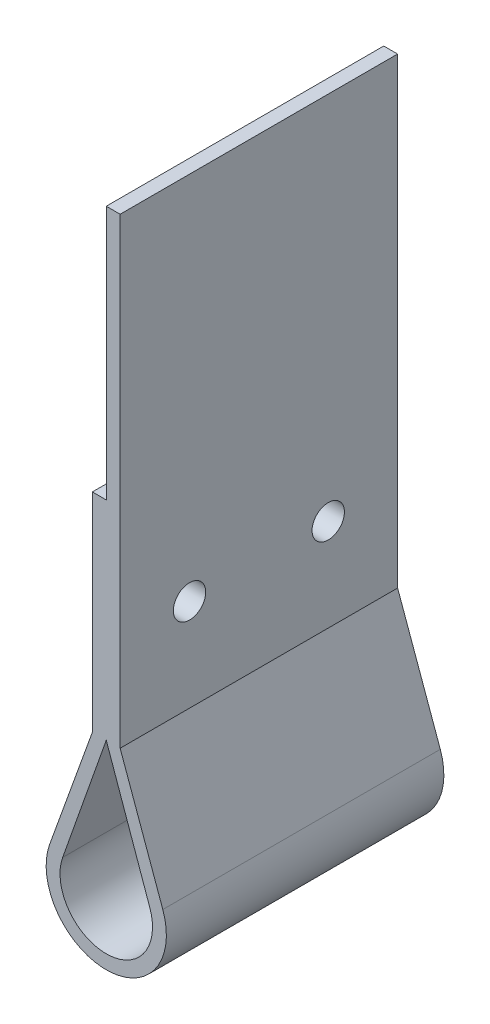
ISO-10303-21;
HEADER;
FILE_DESCRIPTION(('STEP AP214'),'2;1');
FILE_NAME('part.step','',(''),(''),'','','');
FILE_SCHEMA(('AUTOMOTIVE_DESIGN { 1 0 10303 214 1 1 1 1 }'));
ENDSEC;
DATA;
#1=APPLICATION_CONTEXT('core data for automotive mechanical design processes');
#2=APPLICATION_PROTOCOL_DEFINITION('international standard','automotive_design',2000,#1);
#3=PRODUCT_CONTEXT('',#1,'mechanical');
#4=PRODUCT('Part','Part','',(#3));
#5=PRODUCT_RELATED_PRODUCT_CATEGORY('part','',(#4));
#6=PRODUCT_DEFINITION_FORMATION('','',#4);
#7=PRODUCT_DEFINITION_CONTEXT('part definition',#1,'design');
#8=PRODUCT_DEFINITION('design','',#6,#7);
#9=PRODUCT_DEFINITION_SHAPE('','',#8);
#10=(LENGTH_UNIT() NAMED_UNIT(*) SI_UNIT(.MILLI.,.METRE.));
#11=(NAMED_UNIT(*) PLANE_ANGLE_UNIT() SI_UNIT($,.RADIAN.));
#12=(NAMED_UNIT(*) SI_UNIT($,.STERADIAN.) SOLID_ANGLE_UNIT());
#13=UNCERTAINTY_MEASURE_WITH_UNIT(LENGTH_MEASURE(1.E-05),#10,'distance_accuracy_value','');
#14=(GEOMETRIC_REPRESENTATION_CONTEXT(3) GLOBAL_UNCERTAINTY_ASSIGNED_CONTEXT((#13)) GLOBAL_UNIT_ASSIGNED_CONTEXT((#10,
#11,#12)) REPRESENTATION_CONTEXT('',''));
#15=CARTESIAN_POINT('',(0.,0.,0.));
#16=DIRECTION('',(0.,0.,1.));
#17=DIRECTION('',(1.,0.,0.));
#18=AXIS2_PLACEMENT_3D('',#15,#16,#17);
#19=CARTESIAN_POINT('',(0.,0.,60.));
#20=DIRECTION('',(0.,0.,1.));
#21=DIRECTION('',(1.,0.,0.));
#22=AXIS2_PLACEMENT_3D('',#19,#20,#21);
#23=PLANE('',#22);
#24=DIRECTION('',(-1.,0.,0.));
#25=VECTOR('',#24,1.);
#26=CARTESIAN_POINT('',(-3.,75.,60.));
#27=LINE('',#26,#25);
#28=CARTESIAN_POINT('',(-1.94811787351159E-12,75.,60.));
#29=VERTEX_POINT('',#28);
#30=CARTESIAN_POINT('',(-3.,75.,60.));
#31=VERTEX_POINT('',#30);
#32=EDGE_CURVE('E144',#29,#31,#27,.T.);
#33=ORIENTED_EDGE('',*,*,#32,.T.);
#34=DIRECTION('',(0.,-1.,0.));
#35=VECTOR('',#34,1.);
#36=CARTESIAN_POINT('',(-3.,75.,60.));
#37=LINE('',#36,#35);
#38=CARTESIAN_POINT('',(-3.,30.,60.));
#39=VERTEX_POINT('',#38);
#40=EDGE_CURVE('E147',#31,#39,#37,.T.);
#41=ORIENTED_EDGE('',*,*,#40,.T.);
#42=DIRECTION('',(-0.339264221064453,-0.940691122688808,0.));
#43=VECTOR('',#42,1.);
#44=CARTESIAN_POINT('',(-3.,30.,60.));
#45=LINE('',#44,#43);
#46=CARTESIAN_POINT('',(-12.2289845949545,4.41043487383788,60.));
#47=VERTEX_POINT('',#46);
#48=EDGE_CURVE('E150',#39,#47,#45,.T.);
#49=ORIENTED_EDGE('',*,*,#48,.T.);
#50=CARTESIAN_POINT('',(0.,0.,60.));
#51=DIRECTION('',(0.,0.,1.));
#52=DIRECTION('',(1.,0.,0.));
#53=AXIS2_PLACEMENT_3D('',#50,#51,#52);
#54=CIRCLE('',#53,13.);
#55=CARTESIAN_POINT('',(12.2289845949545,4.41043487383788,60.));
#56=VERTEX_POINT('',#55);
#57=EDGE_CURVE('E152',#47,#56,#54,.T.);
#58=ORIENTED_EDGE('',*,*,#57,.T.);
#59=DIRECTION('',(-0.339264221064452,0.940691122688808,0.));
#60=VECTOR('',#59,1.);
#61=CARTESIAN_POINT('',(3.00000000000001,30.,60.));
#62=LINE('',#61,#60);
#63=CARTESIAN_POINT('',(3.00000000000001,30.,60.));
#64=VERTEX_POINT('',#63);
#65=EDGE_CURVE('E154',#56,#64,#62,.T.);
#66=ORIENTED_EDGE('',*,*,#65,.T.);
#67=DIRECTION('',(0.,1.,0.));
#68=VECTOR('',#67,1.);
#69=CARTESIAN_POINT('',(3.,130.,60.));
#70=LINE('',#69,#68);
#71=CARTESIAN_POINT('',(3.,130.,60.));
#72=VERTEX_POINT('',#71);
#73=EDGE_CURVE('E156',#64,#72,#70,.T.);
#74=ORIENTED_EDGE('',*,*,#73,.T.);
#75=DIRECTION('',(-1.,0.,0.));
#76=VECTOR('',#75,1.);
#77=CARTESIAN_POINT('',(-1.9499403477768E-12,130.,60.));
#78=LINE('',#77,#76);
#79=CARTESIAN_POINT('',(-1.9499403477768E-12,130.,60.));
#80=VERTEX_POINT('',#79);
#81=EDGE_CURVE('E158',#72,#80,#78,.T.);
#82=ORIENTED_EDGE('',*,*,#81,.T.);
#83=DIRECTION('',(0.,-1.,0.));
#84=VECTOR('',#83,1.);
#85=CARTESIAN_POINT('',(-1.94811787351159E-12,75.,60.));
#86=LINE('',#85,#84);
#87=EDGE_CURVE('E160',#80,#29,#86,.T.);
#88=ORIENTED_EDGE('',*,*,#87,.T.);
#89=EDGE_LOOP('',(#33,#41,#49,#58,#66,#74,#82,#88));
#90=FACE_BOUND('',#89,.T.);
#91=DIRECTION('',(-0.333333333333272,-0.942809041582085,0.));
#92=VECTOR('',#91,1.);
#93=CARTESIAN_POINT('',(-1.94666932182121E-12,30.,60.));
#94=LINE('',#93,#92);
#95=CARTESIAN_POINT('',(-1.94666932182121E-12,30.,60.));
#96=VERTEX_POINT('',#95);
#97=CARTESIAN_POINT('',(-9.42809041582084,3.33333333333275,60.));
#98=VERTEX_POINT('',#97);
#99=EDGE_CURVE('E123',#96,#98,#94,.T.);
#100=ORIENTED_EDGE('',*,*,#99,.F.);
#101=DIRECTION('',(-0.333333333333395,0.942809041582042,0.));
#102=VECTOR('',#101,1.);
#103=CARTESIAN_POINT('',(-1.94666932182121E-12,30.,60.));
#104=LINE('',#103,#102);
#105=CARTESIAN_POINT('',(9.42809041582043,3.33333333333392,60.));
#106=VERTEX_POINT('',#105);
#107=EDGE_CURVE('E115',#106,#96,#104,.T.);
#108=ORIENTED_EDGE('',*,*,#107,.F.);
#109=CARTESIAN_POINT('',(0.,0.,60.));
#110=DIRECTION('',(0.,0.,1.));
#111=DIRECTION('',(1.,0.,0.));
#112=AXIS2_PLACEMENT_3D('',#109,#110,#111);
#113=CIRCLE('',#112,10.);
#114=EDGE_CURVE('E132',#98,#106,#113,.T.);
#115=ORIENTED_EDGE('',*,*,#114,.F.);
#116=EDGE_LOOP('',(#100,#108,#115));
#117=FACE_BOUND('',#116,.T.);
#118=ADVANCED_FACE('F30',(#90,#117),#23,.T.);
#119=CARTESIAN_POINT('',(0.,0.,0.));
#120=DIRECTION('',(0.,0.,1.));
#121=DIRECTION('',(1.,0.,0.));
#122=AXIS2_PLACEMENT_3D('',#119,#120,#121);
#123=PLANE('',#122);
#124=DIRECTION('',(-1.,0.,0.));
#125=VECTOR('',#124,1.);
#126=CARTESIAN_POINT('',(-3.,75.,0.));
#127=LINE('',#126,#125);
#128=CARTESIAN_POINT('',(-1.94811787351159E-12,75.,0.));
#129=VERTEX_POINT('',#128);
#130=CARTESIAN_POINT('',(-3.,75.,0.));
#131=VERTEX_POINT('',#130);
#132=EDGE_CURVE('E130',#129,#131,#127,.T.);
#133=ORIENTED_EDGE('',*,*,#132,.F.);
#134=DIRECTION('',(0.,-1.,0.));
#135=VECTOR('',#134,1.);
#136=CARTESIAN_POINT('',(-1.94811787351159E-12,75.,0.));
#137=LINE('',#136,#135);
#138=CARTESIAN_POINT('',(-1.9499403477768E-12,130.,0.));
#139=VERTEX_POINT('',#138);
#140=EDGE_CURVE('E148',#139,#129,#137,.T.);
#141=ORIENTED_EDGE('',*,*,#140,.F.);
#142=DIRECTION('',(-1.,0.,0.));
#143=VECTOR('',#142,1.);
#144=CARTESIAN_POINT('',(-1.9499403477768E-12,130.,0.));
#145=LINE('',#144,#143);
#146=CARTESIAN_POINT('',(3.,130.,0.));
#147=VERTEX_POINT('',#146);
#148=EDGE_CURVE('E175',#147,#139,#145,.T.);
#149=ORIENTED_EDGE('',*,*,#148,.F.);
#150=DIRECTION('',(0.,1.,0.));
#151=VECTOR('',#150,1.);
#152=CARTESIAN_POINT('',(3.,130.,0.));
#153=LINE('',#152,#151);
#154=CARTESIAN_POINT('',(3.00000000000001,30.,0.));
#155=VERTEX_POINT('',#154);
#156=EDGE_CURVE('E173',#155,#147,#153,.T.);
#157=ORIENTED_EDGE('',*,*,#156,.F.);
#158=DIRECTION('',(-0.339264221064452,0.940691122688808,0.));
#159=VECTOR('',#158,1.);
#160=CARTESIAN_POINT('',(3.00000000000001,30.,0.));
#161=LINE('',#160,#159);
#162=CARTESIAN_POINT('',(12.2289845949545,4.41043487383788,0.));
#163=VERTEX_POINT('',#162);
#164=EDGE_CURVE('E171',#163,#155,#161,.T.);
#165=ORIENTED_EDGE('',*,*,#164,.F.);
#166=CARTESIAN_POINT('',(0.,0.,0.));
#167=DIRECTION('',(0.,0.,1.));
#168=DIRECTION('',(1.,0.,0.));
#169=AXIS2_PLACEMENT_3D('',#166,#167,#168);
#170=CIRCLE('',#169,13.);
#171=CARTESIAN_POINT('',(-12.2289845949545,4.41043487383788,0.));
#172=VERTEX_POINT('',#171);
#173=EDGE_CURVE('E169',#172,#163,#170,.T.);
#174=ORIENTED_EDGE('',*,*,#173,.F.);
#175=DIRECTION('',(-0.339264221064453,-0.940691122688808,0.));
#176=VECTOR('',#175,1.);
#177=CARTESIAN_POINT('',(-3.,30.,0.));
#178=LINE('',#177,#176);
#179=CARTESIAN_POINT('',(-3.,30.,0.));
#180=VERTEX_POINT('',#179);
#181=EDGE_CURVE('E167',#180,#172,#178,.T.);
#182=ORIENTED_EDGE('',*,*,#181,.F.);
#183=DIRECTION('',(0.,-1.,0.));
#184=VECTOR('',#183,1.);
#185=CARTESIAN_POINT('',(-3.,75.,0.));
#186=LINE('',#185,#184);
#187=EDGE_CURVE('E165',#131,#180,#186,.T.);
#188=ORIENTED_EDGE('',*,*,#187,.F.);
#189=EDGE_LOOP('',(#133,#141,#149,#157,#165,#174,#182,#188));
#190=FACE_BOUND('',#189,.T.);
#191=DIRECTION('',(-0.333333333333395,0.942809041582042,0.));
#192=VECTOR('',#191,1.);
#193=CARTESIAN_POINT('',(-1.94666932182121E-12,30.,0.));
#194=LINE('',#193,#192);
#195=CARTESIAN_POINT('',(9.42809041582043,3.33333333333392,0.));
#196=VERTEX_POINT('',#195);
#197=CARTESIAN_POINT('',(-1.94666932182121E-12,30.,0.));
#198=VERTEX_POINT('',#197);
#199=EDGE_CURVE('E55',#196,#198,#194,.T.);
#200=ORIENTED_EDGE('',*,*,#199,.T.);
#201=DIRECTION('',(-0.333333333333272,-0.942809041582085,0.));
#202=VECTOR('',#201,1.);
#203=CARTESIAN_POINT('',(-1.94666932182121E-12,30.,0.));
#204=LINE('',#203,#202);
#205=CARTESIAN_POINT('',(-9.42809041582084,3.33333333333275,0.));
#206=VERTEX_POINT('',#205);
#207=EDGE_CURVE('E129',#198,#206,#204,.T.);
#208=ORIENTED_EDGE('',*,*,#207,.T.);
#209=CARTESIAN_POINT('',(0.,0.,0.));
#210=DIRECTION('',(0.,0.,1.));
#211=DIRECTION('',(1.,0.,0.));
#212=AXIS2_PLACEMENT_3D('',#209,#210,#211);
#213=CIRCLE('',#212,10.);
#214=EDGE_CURVE('E124',#206,#196,#213,.T.);
#215=ORIENTED_EDGE('',*,*,#214,.T.);
#216=EDGE_LOOP('',(#200,#208,#215));
#217=FACE_BOUND('',#216,.T.);
#218=ADVANCED_FACE('F226',(#190,#217),#123,.F.);
#219=CARTESIAN_POINT('',(-3.,75.,60.));
#220=DIRECTION('',(0.,-1.,0.));
#221=DIRECTION('',(1.,0.,0.));
#222=AXIS2_PLACEMENT_3D('',#219,#220,#221);
#223=PLANE('',#222);
#224=ORIENTED_EDGE('',*,*,#132,.T.);
#225=DIRECTION('',(0.,0.,-1.));
#226=VECTOR('',#225,1.);
#227=CARTESIAN_POINT('',(-3.,75.,60.));
#228=LINE('',#227,#226);
#229=EDGE_CURVE('E11',#31,#131,#228,.T.);
#230=ORIENTED_EDGE('',*,*,#229,.F.);
#231=ORIENTED_EDGE('',*,*,#32,.F.);
#232=DIRECTION('',(0.,0.,-1.));
#233=VECTOR('',#232,1.);
#234=CARTESIAN_POINT('',(-1.94811787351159E-12,75.,60.));
#235=LINE('',#234,#233);
#236=EDGE_CURVE('E162',#29,#129,#235,.T.);
#237=ORIENTED_EDGE('',*,*,#236,.T.);
#238=EDGE_LOOP('',(#224,#230,#231,#237));
#239=FACE_BOUND('',#238,.T.);
#240=ADVANCED_FACE('F32',(#239),#223,.F.);
#241=CARTESIAN_POINT('',(-3.,75.,60.));
#242=DIRECTION('',(1.,0.,0.));
#243=DIRECTION('',(0.,1.,0.));
#244=AXIS2_PLACEMENT_3D('',#241,#242,#243);
#245=PLANE('',#244);
#246=CARTESIAN_POINT('',(-3.,50.,45.));
#247=DIRECTION('',(-1.,0.,0.));
#248=DIRECTION('',(0.,-1.,0.));
#249=AXIS2_PLACEMENT_3D('',#246,#247,#248);
#250=CIRCLE('',#249,3.5);
#251=CARTESIAN_POINT('',(-3.,46.5,45.));
#252=VERTEX_POINT('',#251);
#253=EDGE_CURVE('E204',#252,#252,#250,.T.);
#254=ORIENTED_EDGE('',*,*,#253,.F.);
#255=EDGE_LOOP('',(#254));
#256=FACE_BOUND('',#255,.T.);
#257=CARTESIAN_POINT('',(-3.,50.,15.));
#258=DIRECTION('',(-1.,0.,0.));
#259=DIRECTION('',(0.,-1.,0.));
#260=AXIS2_PLACEMENT_3D('',#257,#258,#259);
#261=CIRCLE('',#260,3.5);
#262=CARTESIAN_POINT('',(-3.,46.5,15.));
#263=VERTEX_POINT('',#262);
#264=EDGE_CURVE('E197',#263,#263,#261,.T.);
#265=ORIENTED_EDGE('',*,*,#264,.F.);
#266=EDGE_LOOP('',(#265));
#267=FACE_BOUND('',#266,.T.);
#268=ORIENTED_EDGE('',*,*,#187,.T.);
#269=DIRECTION('',(0.,0.,-1.));
#270=VECTOR('',#269,1.);
#271=CARTESIAN_POINT('',(-3.,30.,60.));
#272=LINE('',#271,#270);
#273=EDGE_CURVE('E39',#39,#180,#272,.T.);
#274=ORIENTED_EDGE('',*,*,#273,.F.);
#275=ORIENTED_EDGE('',*,*,#40,.F.);
#276=ORIENTED_EDGE('',*,*,#229,.T.);
#277=EDGE_LOOP('',(#268,#274,#275,#276));
#278=FACE_BOUND('',#277,.T.);
#279=ADVANCED_FACE('F212',(#256,#267,#278),#245,.F.);
#280=CARTESIAN_POINT('',(-3.,30.,60.));
#281=DIRECTION('',(0.940691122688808,-0.339264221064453,0.));
#282=DIRECTION('',(0.339264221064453,0.940691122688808,0.));
#283=AXIS2_PLACEMENT_3D('',#280,#281,#282);
#284=PLANE('',#283);
#285=ORIENTED_EDGE('',*,*,#181,.T.);
#286=DIRECTION('',(0.,0.,-1.));
#287=VECTOR('',#286,1.);
#288=CARTESIAN_POINT('',(-12.2289845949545,4.41043487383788,60.));
#289=LINE('',#288,#287);
#290=EDGE_CURVE('E192',#47,#172,#289,.T.);
#291=ORIENTED_EDGE('',*,*,#290,.F.);
#292=ORIENTED_EDGE('',*,*,#48,.F.);
#293=ORIENTED_EDGE('',*,*,#273,.T.);
#294=EDGE_LOOP('',(#285,#291,#292,#293));
#295=FACE_BOUND('',#294,.T.);
#296=ADVANCED_FACE('F215',(#295),#284,.F.);
#297=CARTESIAN_POINT('',(0.,0.,60.));
#298=DIRECTION('',(0.,0.,-1.));
#299=DIRECTION('',(-1.,0.,0.));
#300=AXIS2_PLACEMENT_3D('',#297,#298,#299);
#301=CYLINDRICAL_SURFACE('',#300,13.);
#302=ORIENTED_EDGE('',*,*,#173,.T.);
#303=DIRECTION('',(0.,0.,-1.));
#304=VECTOR('',#303,1.);
#305=CARTESIAN_POINT('',(12.2289845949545,4.41043487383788,60.));
#306=LINE('',#305,#304);
#307=EDGE_CURVE('E189',#56,#163,#306,.T.);
#308=ORIENTED_EDGE('',*,*,#307,.F.);
#309=ORIENTED_EDGE('',*,*,#57,.F.);
#310=ORIENTED_EDGE('',*,*,#290,.T.);
#311=EDGE_LOOP('',(#302,#308,#309,#310));
#312=FACE_BOUND('',#311,.T.);
#313=ADVANCED_FACE('F232',(#312),#301,.T.);
#314=CARTESIAN_POINT('',(3.00000000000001,30.,60.));
#315=DIRECTION('',(-0.940691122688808,-0.339264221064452,0.));
#316=DIRECTION('',(0.339264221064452,-0.940691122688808,0.));
#317=AXIS2_PLACEMENT_3D('',#314,#315,#316);
#318=PLANE('',#317);
#319=ORIENTED_EDGE('',*,*,#164,.T.);
#320=DIRECTION('',(0.,0.,-1.));
#321=VECTOR('',#320,1.);
#322=CARTESIAN_POINT('',(3.00000000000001,30.,60.));
#323=LINE('',#322,#321);
#324=EDGE_CURVE('E186',#64,#155,#323,.T.);
#325=ORIENTED_EDGE('',*,*,#324,.F.);
#326=ORIENTED_EDGE('',*,*,#65,.F.);
#327=ORIENTED_EDGE('',*,*,#307,.T.);
#328=EDGE_LOOP('',(#319,#325,#326,#327));
#329=FACE_BOUND('',#328,.T.);
#330=ADVANCED_FACE('F236',(#329),#318,.F.);
#331=CARTESIAN_POINT('',(3.,130.,60.));
#332=DIRECTION('',(-1.,0.,0.));
#333=DIRECTION('',(0.,-1.,0.));
#334=AXIS2_PLACEMENT_3D('',#331,#332,#333);
#335=PLANE('',#334);
#336=CARTESIAN_POINT('',(3.,50.,45.));
#337=DIRECTION('',(-1.,0.,0.));
#338=DIRECTION('',(0.,-1.,0.));
#339=AXIS2_PLACEMENT_3D('',#336,#337,#338);
#340=CIRCLE('',#339,3.5);
#341=CARTESIAN_POINT('',(3.,46.5,45.));
#342=VERTEX_POINT('',#341);
#343=EDGE_CURVE('E34',#342,#342,#340,.T.);
#344=ORIENTED_EDGE('',*,*,#343,.T.);
#345=EDGE_LOOP('',(#344));
#346=FACE_BOUND('',#345,.T.);
#347=CARTESIAN_POINT('',(3.,50.,15.));
#348=DIRECTION('',(-1.,0.,0.));
#349=DIRECTION('',(0.,-1.,0.));
#350=AXIS2_PLACEMENT_3D('',#347,#348,#349);
#351=CIRCLE('',#350,3.5);
#352=CARTESIAN_POINT('',(3.,46.5,15.));
#353=VERTEX_POINT('',#352);
#354=EDGE_CURVE('E138',#353,#353,#351,.T.);
#355=ORIENTED_EDGE('',*,*,#354,.T.);
#356=EDGE_LOOP('',(#355));
#357=FACE_BOUND('',#356,.T.);
#358=ORIENTED_EDGE('',*,*,#156,.T.);
#359=DIRECTION('',(0.,0.,-1.));
#360=VECTOR('',#359,1.);
#361=CARTESIAN_POINT('',(3.,130.,60.));
#362=LINE('',#361,#360);
#363=EDGE_CURVE('E183',#72,#147,#362,.T.);
#364=ORIENTED_EDGE('',*,*,#363,.F.);
#365=ORIENTED_EDGE('',*,*,#73,.F.);
#366=ORIENTED_EDGE('',*,*,#324,.T.);
#367=EDGE_LOOP('',(#358,#364,#365,#366));
#368=FACE_BOUND('',#367,.T.);
#369=ADVANCED_FACE('F254',(#346,#357,#368),#335,.F.);
#370=CARTESIAN_POINT('',(-1.9499403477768E-12,130.,60.));
#371=DIRECTION('',(0.,-1.,0.));
#372=DIRECTION('',(0.,0.,-1.));
#373=AXIS2_PLACEMENT_3D('',#370,#371,#372);
#374=PLANE('',#373);
#375=ORIENTED_EDGE('',*,*,#148,.T.);
#376=DIRECTION('',(0.,0.,-1.));
#377=VECTOR('',#376,1.);
#378=CARTESIAN_POINT('',(-1.9499403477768E-12,130.,60.));
#379=LINE('',#378,#377);
#380=EDGE_CURVE('E180',#80,#139,#379,.T.);
#381=ORIENTED_EDGE('',*,*,#380,.F.);
#382=ORIENTED_EDGE('',*,*,#81,.F.);
#383=ORIENTED_EDGE('',*,*,#363,.T.);
#384=EDGE_LOOP('',(#375,#381,#382,#383));
#385=FACE_BOUND('',#384,.T.);
#386=ADVANCED_FACE('F252',(#385),#374,.F.);
#387=CARTESIAN_POINT('',(-1.94811787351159E-12,75.,60.));
#388=DIRECTION('',(1.,0.,0.));
#389=DIRECTION('',(0.,1.,0.));
#390=AXIS2_PLACEMENT_3D('',#387,#388,#389);
#391=PLANE('',#390);
#392=ORIENTED_EDGE('',*,*,#140,.T.);
#393=ORIENTED_EDGE('',*,*,#236,.F.);
#394=ORIENTED_EDGE('',*,*,#87,.F.);
#395=ORIENTED_EDGE('',*,*,#380,.T.);
#396=EDGE_LOOP('',(#392,#393,#394,#395));
#397=FACE_BOUND('',#396,.T.);
#398=ADVANCED_FACE('F248',(#397),#391,.F.);
#399=CARTESIAN_POINT('',(-1.94666932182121E-12,30.,60.));
#400=DIRECTION('',(-0.942809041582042,-0.333333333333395,0.));
#401=DIRECTION('',(0.333333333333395,-0.942809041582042,0.));
#402=AXIS2_PLACEMENT_3D('',#399,#400,#401);
#403=PLANE('',#402);
#404=ORIENTED_EDGE('',*,*,#199,.F.);
#405=DIRECTION('',(0.,0.,-1.));
#406=VECTOR('',#405,1.);
#407=CARTESIAN_POINT('',(9.42809041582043,3.33333333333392,60.));
#408=LINE('',#407,#406);
#409=EDGE_CURVE('E119',#106,#196,#408,.T.);
#410=ORIENTED_EDGE('',*,*,#409,.F.);
#411=ORIENTED_EDGE('',*,*,#107,.T.);
#412=DIRECTION('',(0.,0.,-1.));
#413=VECTOR('',#412,1.);
#414=CARTESIAN_POINT('',(-1.94666932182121E-12,30.,60.));
#415=LINE('',#414,#413);
#416=EDGE_CURVE('E118',#96,#198,#415,.T.);
#417=ORIENTED_EDGE('',*,*,#416,.T.);
#418=EDGE_LOOP('',(#404,#410,#411,#417));
#419=FACE_BOUND('',#418,.T.);
#420=ADVANCED_FACE('F117',(#419),#403,.T.);
#421=CARTESIAN_POINT('',(-1.94666932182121E-12,30.,60.));
#422=DIRECTION('',(0.942809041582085,-0.333333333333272,0.));
#423=DIRECTION('',(0.333333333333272,0.942809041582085,0.));
#424=AXIS2_PLACEMENT_3D('',#421,#422,#423);
#425=PLANE('',#424);
#426=ORIENTED_EDGE('',*,*,#207,.F.);
#427=ORIENTED_EDGE('',*,*,#416,.F.);
#428=ORIENTED_EDGE('',*,*,#99,.T.);
#429=DIRECTION('',(0.,0.,-1.));
#430=VECTOR('',#429,1.);
#431=CARTESIAN_POINT('',(-9.42809041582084,3.33333333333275,60.));
#432=LINE('',#431,#430);
#433=EDGE_CURVE('E47',#98,#206,#432,.T.);
#434=ORIENTED_EDGE('',*,*,#433,.T.);
#435=EDGE_LOOP('',(#426,#427,#428,#434));
#436=FACE_BOUND('',#435,.T.);
#437=ADVANCED_FACE('F127',(#436),#425,.T.);
#438=CARTESIAN_POINT('',(0.,0.,60.));
#439=DIRECTION('',(0.,0.,-1.));
#440=DIRECTION('',(-1.,0.,0.));
#441=AXIS2_PLACEMENT_3D('',#438,#439,#440);
#442=CYLINDRICAL_SURFACE('',#441,10.);
#443=ORIENTED_EDGE('',*,*,#214,.F.);
#444=ORIENTED_EDGE('',*,*,#433,.F.);
#445=ORIENTED_EDGE('',*,*,#114,.T.);
#446=ORIENTED_EDGE('',*,*,#409,.T.);
#447=EDGE_LOOP('',(#443,#444,#445,#446));
#448=FACE_BOUND('',#447,.T.);
#449=ADVANCED_FACE('F280',(#448),#442,.F.);
#450=CARTESIAN_POINT('',(13.,50.,15.));
#451=DIRECTION('',(-1.,0.,0.));
#452=DIRECTION('',(0.,-1.,0.));
#453=AXIS2_PLACEMENT_3D('',#450,#451,#452);
#454=CYLINDRICAL_SURFACE('',#453,3.5);
#455=ORIENTED_EDGE('',*,*,#264,.T.);
#456=EDGE_LOOP('',(#455));
#457=FACE_BOUND('',#456,.T.);
#458=ORIENTED_EDGE('',*,*,#354,.F.);
#459=EDGE_LOOP('',(#458));
#460=FACE_BOUND('',#459,.T.);
#461=ADVANCED_FACE('F284',(#457,#460),#454,.F.);
#462=CARTESIAN_POINT('',(13.,50.,45.));
#463=DIRECTION('',(-1.,0.,0.));
#464=DIRECTION('',(0.,-1.,0.));
#465=AXIS2_PLACEMENT_3D('',#462,#463,#464);
#466=CYLINDRICAL_SURFACE('',#465,3.5);
#467=ORIENTED_EDGE('',*,*,#253,.T.);
#468=EDGE_LOOP('',(#467));
#469=FACE_BOUND('',#468,.T.);
#470=ORIENTED_EDGE('',*,*,#343,.F.);
#471=EDGE_LOOP('',(#470));
#472=FACE_BOUND('',#471,.T.);
#473=ADVANCED_FACE('F209',(#469,#472),#466,.F.);
#474=CLOSED_SHELL('',(#118,#218,#240,#279,#296,#313,#330,#369,#386,#398,#420,#437,#449,#461,#473));
#475=MANIFOLD_SOLID_BREP('B2',#474);
#476=ADVANCED_BREP_SHAPE_REPRESENTATION('',(#18,#475),#14);
#477=SHAPE_DEFINITION_REPRESENTATION(#9,#476);
ENDSEC;
END-ISO-10303-21;
